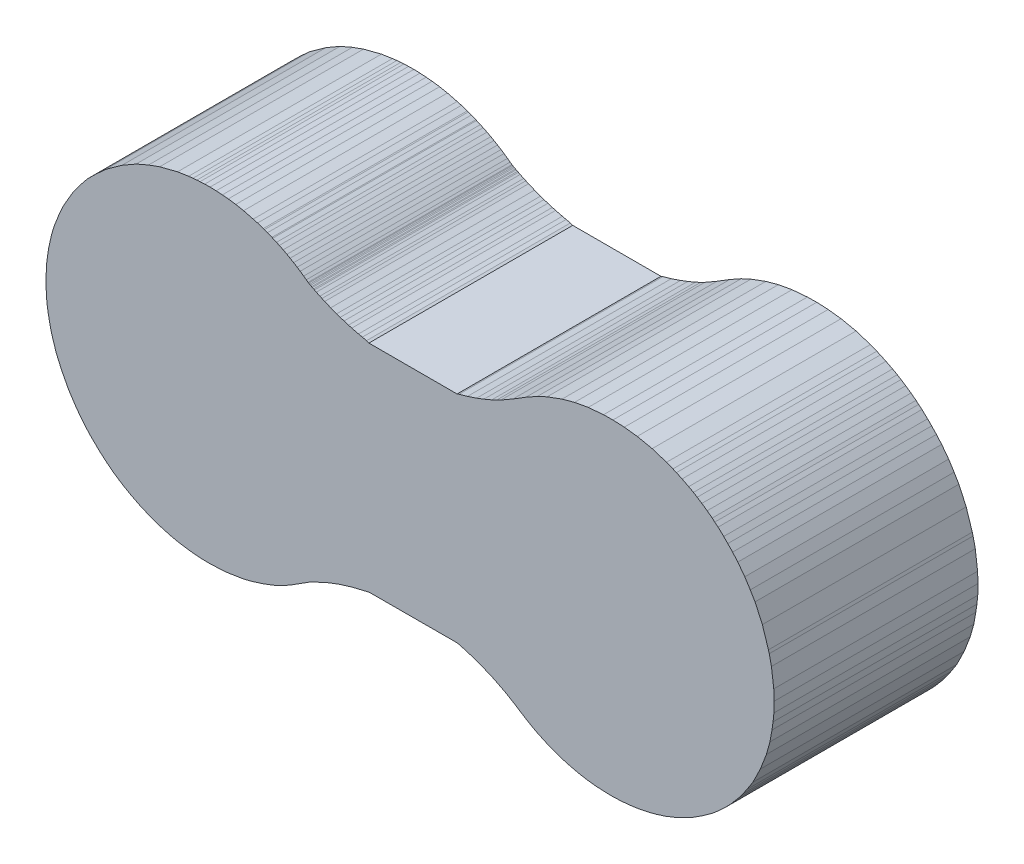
from build123d import *

# Parameters (mm, degrees)
BOSS_EXTRUDE1_DEPTH = 0.508


with BuildPart() as part:
    # GENERAL → Boss-Extrude1 (new body)
    with BuildSketch(Plane.XY):
        Polygon((0.118141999, 0.267204), (-0.101674, 0.267204), (-0.107510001, 0.269542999), (-0.118094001, 0.271783), (-0.127613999, 0.273910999), (-0.144343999, 0.278097), (-0.152575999, 0.280449), (-0.163636, 0.283935), (-0.173268, 0.28692), (-0.182088, 0.290069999), (-0.19683, 0.29574), (-0.21195, 0.301787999), (-0.218627, 0.30491), (-0.223926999, 0.307334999), (-0.232652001, 0.311509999), (-0.235727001, 0.313085), (-0.237359, 0.313922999), (-0.239493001, 0.315001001), (-0.242628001, 0.316618), (-0.244409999, 0.317564), (-0.247280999, 0.319104), (-0.249459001, 0.320281), (-0.251635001, 0.321495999), (-0.252768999, 0.322126), (-0.257747, 0.325758), (-0.26426, 0.330515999), (-0.272957, 0.336521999), (-0.280444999, 0.341474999), (-0.289220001, 0.346935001), (-0.298112, 0.352161), (-0.306028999, 0.356567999), (-0.315466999, 0.361560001), (-0.325061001, 0.366279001), (-0.331964, 0.369437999), (-0.341401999, 0.373572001), (-0.343421, 0.374434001), (-0.354558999, 0.378909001), (-0.362191, 0.381740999), (-0.364902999, 0.382676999), (-0.379176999, 0.387548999), (-0.389923, 0.390573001), (-0.414061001, 0.396675), (-0.433501, 0.400509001), (-0.452185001, 0.403046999), (-0.466927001, 0.404396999), (-0.482317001, 0.405477), (-0.497599, 0.405855), (-0.510892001, 0.405666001), (-0.522483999, 0.405126), (-0.530332, 0.404657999), (-0.53998, 0.40383), (-0.55096, 0.40257), (-0.578466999, 0.398404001), (-0.623119, 0.386875), (-0.650752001, 0.376993), (-0.681861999, 0.363451), (-0.716815, 0.343321), (-0.757623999, 0.314041), (-0.782146, 0.291532), (-0.802825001, 0.271219), (-0.824235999, 0.244683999), (-0.839424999, 0.223273), (-0.861385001, 0.185941), (-0.872364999, 0.162334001), (-0.881092, 0.140156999), (-0.884941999, 0.130256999), (-0.892092, 0.107707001), (-0.900067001, 0.071682), (-0.904467, 0.040882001), (-0.906392, 0.006231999), (-0.906392, -0.011368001), (-0.904191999, -0.046843), (-0.900892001, -0.068293), (-0.894292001, -0.100468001), (-0.887691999, -0.122743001), (-0.880542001, -0.144467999), (-0.868166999, -0.172793), (-0.850567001, -0.206617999), (-0.831042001, -0.236318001), (-0.817774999, -0.254454), (-0.804355, -0.270192), (-0.794229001, -0.281049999), (-0.773732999, -0.301058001), (-0.754518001, -0.317711), (-0.737423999, -0.330809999), (-0.723897, -0.339963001), (-0.713691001, -0.346443), (-0.696175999, -0.356610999), (-0.670508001, -0.369651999), (-0.650014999, -0.378139), (-0.628280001, -0.386419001), (-0.599507, -0.394699), (-0.575702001, -0.400081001), (-0.547756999, -0.404221), (-0.523538, -0.406498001), (-0.502009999, -0.407119), (-0.463922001, -0.405669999), (-0.447776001, -0.403600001), (-0.413413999, -0.398011), (-0.391886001, -0.392628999), (-0.363527, -0.383521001), (-0.340963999, -0.375034), (-0.323162, -0.366961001), (-0.298528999, -0.353713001), (-0.260374, -0.329545), (-0.249058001, -0.322369), (-0.234154, -0.315055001), (-0.207934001, -0.302773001), (-0.18682, -0.294493), (-0.174124, -0.289939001), (-0.145144, -0.280969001), (-0.126513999, -0.276415), (-0.110230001, -0.272550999), (-0.101260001, -0.270204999), (-0.088564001, -0.270204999), (0.118602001, -0.269856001), (0.126799, -0.271888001), (0.143772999, -0.276856), (0.163230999, -0.283273), (0.179997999, -0.289483), (0.205922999, -0.300206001), (0.222345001, -0.308347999), (0.238215, -0.316489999), (0.260846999, -0.329876), (0.273925, -0.338199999), (0.276549, -0.340086), (0.293271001, -0.350423), (0.307592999, -0.358699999), (0.320148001, -0.365303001), (0.341423, -0.375002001), (0.359343, -0.382281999), (0.382722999, -0.390122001), (0.399663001, -0.394881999), (0.422062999, -0.400061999), (0.442923, -0.403701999), (0.462662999, -0.405942), (0.481702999, -0.407202), (0.505223, -0.407761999), (0.527623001, -0.406922), (0.554222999, -0.404262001), (0.573823, -0.401321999), (0.593703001, -0.397122), (0.612743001, -0.392221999), (0.635843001, -0.385082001), (0.662303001, -0.374581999), (0.682043, -0.365202), (0.706402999, -0.352322), (0.731882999, -0.335802), (0.754283, -0.319562), (0.767723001, -0.308222), (0.785503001, -0.291842), (0.799222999, -0.277842), (0.820083, -0.253342), (0.830443, -0.239482), (0.840383, -0.225062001), (0.855348, -0.20196), (0.873828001, -0.164369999), (0.888948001, -0.125310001), (0.897768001, -0.09381), (0.902807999, -0.065670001), (0.905538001, -0.04677), (0.907637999, -0.026400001), (0.908268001, -0.000780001), (0.907232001, 0.02526), (0.901511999, 0.070877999), (0.896055, 0.095702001), (0.894021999, 0.102978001), (0.878854, 0.149887), (0.860660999, 0.189815), (0.848746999, 0.209778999), (0.835062, 0.231191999), (0.817674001, 0.254215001), (0.804633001, 0.269188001), (0.792718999, 0.281584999), (0.782575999, 0.291889), (0.768498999, 0.305097), (0.760263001, 0.311771), (0.753802, 0.317309), (0.741230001, 0.326776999), (0.728069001, 0.335979), (0.716481, 0.343546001), (0.707037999, 0.349226), (0.695323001, 0.355899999), (0.678776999, 0.364162), (0.664759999, 0.370796), (0.655986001, 0.374434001), (0.639958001, 0.380769), (0.604301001, 0.392353), (0.567015, 0.400135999), (0.534797, 0.403937), (0.506426, 0.405254), (0.483076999, 0.404891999), (0.444886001, 0.401634), (0.410858, 0.395479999), (0.379726, 0.386973), (0.342440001, 0.373217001), (0.318186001, 0.361995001), (0.289768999, 0.346066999), (0.257550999, 0.326157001), (0.227324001, 0.308781), (0.217031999, 0.303615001), (0.204448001, 0.297686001), (0.184967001, 0.289458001), (0.166938, 0.282682), (0.143827, 0.274816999), (0.123001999, 0.268920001), align=None)
    extrude(amount=BOSS_EXTRUDE1_DEPTH)


solid = part.part
